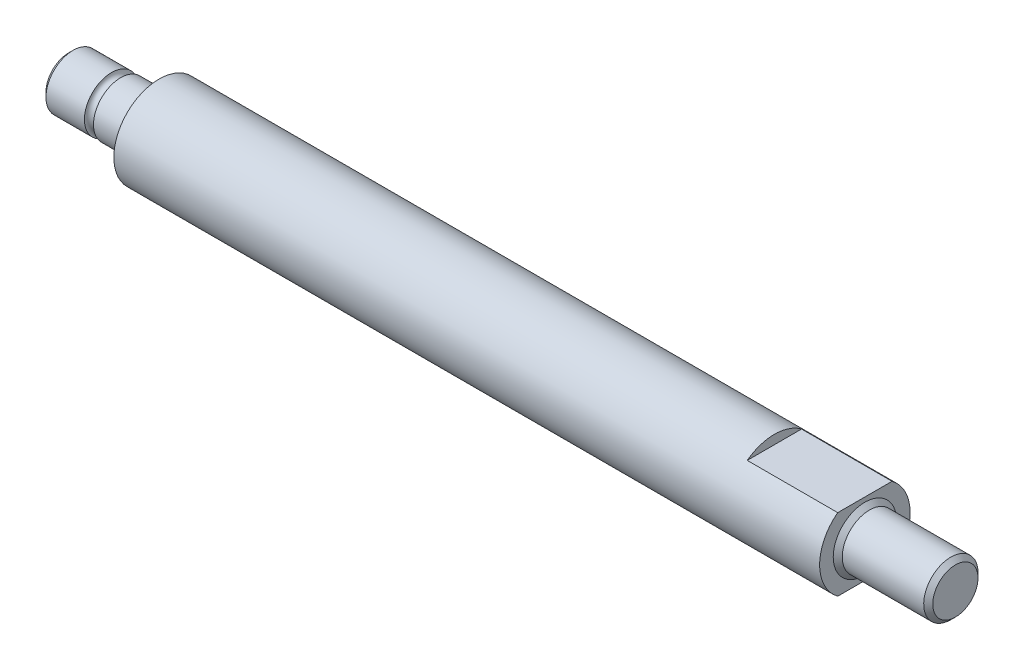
ISO-10303-21;
HEADER;
FILE_DESCRIPTION(('STEP AP214'),'2;1');
FILE_NAME('part.step','',(''),(''),'','','');
FILE_SCHEMA(('AUTOMOTIVE_DESIGN { 1 0 10303 214 1 1 1 1 }'));
ENDSEC;
DATA;
#1=APPLICATION_CONTEXT('core data for automotive mechanical design processes');
#2=APPLICATION_PROTOCOL_DEFINITION('international standard','automotive_design',2000,#1);
#3=PRODUCT_CONTEXT('',#1,'mechanical');
#4=PRODUCT('Part','Part','',(#3));
#5=PRODUCT_RELATED_PRODUCT_CATEGORY('part','',(#4));
#6=PRODUCT_DEFINITION_FORMATION('','',#4);
#7=PRODUCT_DEFINITION_CONTEXT('part definition',#1,'design');
#8=PRODUCT_DEFINITION('design','',#6,#7);
#9=PRODUCT_DEFINITION_SHAPE('','',#8);
#10=(LENGTH_UNIT() NAMED_UNIT(*) SI_UNIT(.MILLI.,.METRE.));
#11=(NAMED_UNIT(*) PLANE_ANGLE_UNIT() SI_UNIT($,.RADIAN.));
#12=(NAMED_UNIT(*) SI_UNIT($,.STERADIAN.) SOLID_ANGLE_UNIT());
#13=UNCERTAINTY_MEASURE_WITH_UNIT(LENGTH_MEASURE(1.E-05),#10,'distance_accuracy_value','');
#14=(GEOMETRIC_REPRESENTATION_CONTEXT(3) GLOBAL_UNCERTAINTY_ASSIGNED_CONTEXT((#13)) GLOBAL_UNIT_ASSIGNED_CONTEXT((#10,
#11,#12)) REPRESENTATION_CONTEXT('',''));
#15=CARTESIAN_POINT('',(0.,0.,0.));
#16=DIRECTION('',(0.,0.,1.));
#17=DIRECTION('',(1.,0.,0.));
#18=AXIS2_PLACEMENT_3D('',#15,#16,#17);
#19=CARTESIAN_POINT('',(-43.4615384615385,0.,5.00000000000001));
#20=DIRECTION('',(-1.,0.,0.));
#21=DIRECTION('',(0.,0.,1.));
#22=AXIS2_PLACEMENT_3D('',#19,#20,#21);
#23=PLANE('',#22);
#24=CARTESIAN_POINT('',(-43.4615384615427,0.,5.00000000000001));
#25=DIRECTION('',(1.,0.,0.));
#26=DIRECTION('',(0.,0.,-1.));
#27=AXIS2_PLACEMENT_3D('',#24,#25,#26);
#28=CIRCLE('',#27,2.50000000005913);
#29=CARTESIAN_POINT('',(-43.4615384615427,0.,2.49999999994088));
#30=VERTEX_POINT('',#29);
#31=EDGE_CURVE('E20',#30,#30,#28,.T.);
#32=ORIENTED_EDGE('',*,*,#31,.F.);
#33=EDGE_LOOP('',(#32));
#34=FACE_BOUND('',#33,.T.);
#35=ADVANCED_FACE('F17',(#34),#23,.T.);
#36=CARTESIAN_POINT('',(-42.9615384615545,0.,5.00000000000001));
#37=DIRECTION('',(1.,0.,0.));
#38=DIRECTION('',(0.,0.,-1.));
#39=AXIS2_PLACEMENT_3D('',#36,#37,#38);
#40=CONICAL_SURFACE('',#39,3.00000000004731,0.785398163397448);
#41=ORIENTED_EDGE('',*,*,#31,.T.);
#42=EDGE_LOOP('',(#41));
#43=FACE_BOUND('',#42,.T.);
#44=CARTESIAN_POINT('',(-42.9615384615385,0.,5.00000000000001));
#45=DIRECTION('',(1.,0.,0.));
#46=DIRECTION('',(0.,0.,-1.));
#47=AXIS2_PLACEMENT_3D('',#44,#45,#46);
#48=CIRCLE('',#47,3.);
#49=CARTESIAN_POINT('',(-42.9615384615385,0.,2.00000000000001));
#50=VERTEX_POINT('',#49);
#51=EDGE_CURVE('E98',#50,#50,#48,.T.);
#52=ORIENTED_EDGE('',*,*,#51,.F.);
#53=EDGE_LOOP('',(#52));
#54=FACE_BOUND('',#53,.T.);
#55=ADVANCED_FACE('F261',(#43,#54),#40,.T.);
#56=CARTESIAN_POINT('',(54.5384615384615,0.,5.));
#57=DIRECTION('',(1.,0.,0.));
#58=DIRECTION('',(0.,0.,-1.));
#59=AXIS2_PLACEMENT_3D('',#56,#57,#58);
#60=CYLINDRICAL_SURFACE('',#59,3.);
#61=ORIENTED_EDGE('',*,*,#51,.T.);
#62=EDGE_LOOP('',(#61));
#63=FACE_BOUND('',#62,.T.);
#64=CARTESIAN_POINT('',(-38.7115384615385,0.,5.00000000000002));
#65=DIRECTION('',(1.,0.,0.));
#66=DIRECTION('',(0.,0.,-1.));
#67=AXIS2_PLACEMENT_3D('',#64,#65,#66);
#68=CIRCLE('',#67,3.00000000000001);
#69=CARTESIAN_POINT('',(-38.7115384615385,0.,2.00000000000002));
#70=VERTEX_POINT('',#69);
#71=EDGE_CURVE('E91',#70,#70,#68,.F.);
#72=ORIENTED_EDGE('',*,*,#71,.T.);
#73=EDGE_LOOP('',(#72));
#74=FACE_BOUND('',#73,.T.);
#75=ADVANCED_FACE('F252',(#63,#74),#60,.T.);
#76=CARTESIAN_POINT('',(54.5384615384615,0.,2.00000000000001));
#77=DIRECTION('',(1.,0.,0.));
#78=DIRECTION('',(0.,0.,-1.));
#79=AXIS2_PLACEMENT_3D('',#76,#77,#78);
#80=PLANE('',#79);
#81=CARTESIAN_POINT('',(54.5384615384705,0.,5.));
#82=DIRECTION('',(-1.,0.,0.));
#83=DIRECTION('',(0.,-1.,0.));
#84=AXIS2_PLACEMENT_3D('',#81,#82,#83);
#85=CIRCLE('',#84,2.49999999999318);
#86=CARTESIAN_POINT('',(54.5384615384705,-2.49999999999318,5.));
#87=VERTEX_POINT('',#86);
#88=EDGE_CURVE('E88',#87,#87,#85,.T.);
#89=ORIENTED_EDGE('',*,*,#88,.F.);
#90=EDGE_LOOP('',(#89));
#91=FACE_BOUND('',#90,.T.);
#92=ADVANCED_FACE('F243',(#91),#80,.T.);
#93=CARTESIAN_POINT('',(-38.2115384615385,0.,5.00000000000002));
#94=DIRECTION('',(1.,0.,0.));
#95=DIRECTION('',(0.,0.,-1.));
#96=AXIS2_PLACEMENT_3D('',#93,#94,#95);
#97=TOROIDAL_SURFACE('',#96,3.00000000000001,0.499999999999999);
#98=ORIENTED_EDGE('',*,*,#71,.F.);
#99=EDGE_LOOP('',(#98));
#100=FACE_BOUND('',#99,.T.);
#101=CARTESIAN_POINT('',(-37.7115384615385,0.,5.00000000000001));
#102=DIRECTION('',(1.,0.,0.));
#103=DIRECTION('',(0.,0.,-1.));
#104=AXIS2_PLACEMENT_3D('',#101,#102,#103);
#105=CIRCLE('',#104,3.);
#106=CARTESIAN_POINT('',(-37.7115384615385,0.,2.00000000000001));
#107=VERTEX_POINT('',#106);
#108=EDGE_CURVE('E90',#107,#107,#105,.T.);
#109=ORIENTED_EDGE('',*,*,#108,.F.);
#110=EDGE_LOOP('',(#109));
#111=FACE_BOUND('',#110,.T.);
#112=ADVANCED_FACE('F235',(#100,#111),#97,.F.);
#113=CARTESIAN_POINT('',(54.0384615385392,0.,5.));
#114=DIRECTION('',(-1.,0.,0.));
#115=DIRECTION('',(0.,-1.,0.));
#116=AXIS2_PLACEMENT_3D('',#113,#114,#115);
#117=CONICAL_SURFACE('',#116,2.99999999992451,0.785398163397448);
#118=ORIENTED_EDGE('',*,*,#88,.T.);
#119=EDGE_LOOP('',(#118));
#120=FACE_BOUND('',#119,.T.);
#121=CARTESIAN_POINT('',(54.0384615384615,0.,5.));
#122=DIRECTION('',(1.,0.,0.));
#123=DIRECTION('',(0.,0.,-1.));
#124=AXIS2_PLACEMENT_3D('',#121,#122,#123);
#125=CIRCLE('',#124,2.99999999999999);
#126=CARTESIAN_POINT('',(54.0384615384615,0.,2.00000000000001));
#127=VERTEX_POINT('',#126);
#128=EDGE_CURVE('E95',#127,#127,#125,.F.);
#129=ORIENTED_EDGE('',*,*,#128,.F.);
#130=EDGE_LOOP('',(#129));
#131=FACE_BOUND('',#130,.T.);
#132=ADVANCED_FACE('F226',(#120,#131),#117,.T.);
#133=CARTESIAN_POINT('',(54.5384615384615,0.,5.));
#134=DIRECTION('',(1.,0.,0.));
#135=DIRECTION('',(0.,0.,-1.));
#136=AXIS2_PLACEMENT_3D('',#133,#134,#135);
#137=CYLINDRICAL_SURFACE('',#136,3.);
#138=ORIENTED_EDGE('',*,*,#108,.T.);
#139=EDGE_LOOP('',(#138));
#140=FACE_BOUND('',#139,.T.);
#141=CARTESIAN_POINT('',(-33.9615384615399,0.,5.00000000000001));
#142=DIRECTION('',(1.,0.,0.));
#143=DIRECTION('',(0.,0.,-1.));
#144=AXIS2_PLACEMENT_3D('',#141,#142,#143);
#145=CIRCLE('',#144,2.99999999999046);
#146=CARTESIAN_POINT('',(-33.9615384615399,0.,2.00000000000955));
#147=VERTEX_POINT('',#146);
#148=EDGE_CURVE('E294',#147,#147,#145,.T.);
#149=ORIENTED_EDGE('',*,*,#148,.F.);
#150=EDGE_LOOP('',(#149));
#151=FACE_BOUND('',#150,.T.);
#152=ADVANCED_FACE('F136',(#140,#151),#137,.T.);
#153=CARTESIAN_POINT('',(54.5384615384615,0.,5.));
#154=DIRECTION('',(1.,0.,0.));
#155=DIRECTION('',(0.,0.,-1.));
#156=AXIS2_PLACEMENT_3D('',#153,#154,#155);
#157=CYLINDRICAL_SURFACE('',#156,2.99999999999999);
#158=CARTESIAN_POINT('',(45.0384615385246,0.,5.));
#159=DIRECTION('',(-1.,0.,0.));
#160=DIRECTION('',(0.,0.,1.));
#161=AXIS2_PLACEMENT_3D('',#158,#159,#160);
#162=CIRCLE('',#161,2.99999999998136);
#163=CARTESIAN_POINT('',(45.0384615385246,0.,7.99999999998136));
#164=VERTEX_POINT('',#163);
#165=EDGE_CURVE('E63',#164,#164,#162,.T.);
#166=ORIENTED_EDGE('',*,*,#165,.F.);
#167=EDGE_LOOP('',(#166));
#168=FACE_BOUND('',#167,.T.);
#169=ORIENTED_EDGE('',*,*,#128,.T.);
#170=EDGE_LOOP('',(#169));
#171=FACE_BOUND('',#170,.T.);
#172=ADVANCED_FACE('F126',(#168,#171),#157,.T.);
#173=CARTESIAN_POINT('',(-33.4615384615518,0.,5.00000000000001));
#174=DIRECTION('',(1.,0.,0.));
#175=DIRECTION('',(0.,0.,-1.));
#176=AXIS2_PLACEMENT_3D('',#173,#174,#175);
#177=CONICAL_SURFACE('',#176,3.49999999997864,0.785398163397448);
#178=ORIENTED_EDGE('',*,*,#148,.T.);
#179=EDGE_LOOP('',(#178));
#180=FACE_BOUND('',#179,.T.);
#181=CARTESIAN_POINT('',(-33.4615384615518,0.,5.00000000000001));
#182=DIRECTION('',(1.,0.,0.));
#183=DIRECTION('',(0.,0.,-1.));
#184=AXIS2_PLACEMENT_3D('',#181,#182,#183);
#185=CIRCLE('',#184,3.49999999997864);
#186=CARTESIAN_POINT('',(-33.4615384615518,0.,1.50000000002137));
#187=VERTEX_POINT('',#186);
#188=EDGE_CURVE('E62',#187,#187,#185,.T.);
#189=ORIENTED_EDGE('',*,*,#188,.F.);
#190=EDGE_LOOP('',(#189));
#191=FACE_BOUND('',#190,.T.);
#192=ADVANCED_FACE('F123',(#180,#191),#177,.T.);
#193=CARTESIAN_POINT('',(44.5384615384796,0.,5.));
#194=DIRECTION('',(-1.,0.,0.));
#195=DIRECTION('',(0.,0.,1.));
#196=AXIS2_PLACEMENT_3D('',#193,#194,#195);
#197=CONICAL_SURFACE('',#196,3.49999999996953,0.785398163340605);
#198=ORIENTED_EDGE('',*,*,#165,.T.);
#199=EDGE_LOOP('',(#198));
#200=FACE_BOUND('',#199,.T.);
#201=CARTESIAN_POINT('',(44.5384615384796,0.,5.));
#202=DIRECTION('',(-1.,0.,0.));
#203=DIRECTION('',(0.,0.,1.));
#204=AXIS2_PLACEMENT_3D('',#201,#202,#203);
#205=CIRCLE('',#204,3.49999999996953);
#206=CARTESIAN_POINT('',(44.5384615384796,0.,8.49999999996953));
#207=VERTEX_POINT('',#206);
#208=EDGE_CURVE('E79',#207,#207,#205,.T.);
#209=ORIENTED_EDGE('',*,*,#208,.F.);
#210=EDGE_LOOP('',(#209));
#211=FACE_BOUND('',#210,.T.);
#212=ADVANCED_FACE('F125',(#200,#211),#197,.T.);
#213=CARTESIAN_POINT('',(34.5384615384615,0.,0.));
#214=DIRECTION('',(-1.,0.,0.));
#215=DIRECTION('',(0.,0.,1.));
#216=AXIS2_PLACEMENT_3D('',#213,#214,#215);
#217=PLANE('',#216);
#218=DIRECTION('',(0.,0.,1.));
#219=VECTOR('',#218,1.);
#220=CARTESIAN_POINT('',(34.5384615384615,-4.,10.442529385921));
#221=LINE('',#220,#219);
#222=CARTESIAN_POINT('',(34.5384615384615,-4.,2.));
#223=VERTEX_POINT('',#222);
#224=CARTESIAN_POINT('',(34.5384615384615,-4.,8.00000000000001));
#225=VERTEX_POINT('',#224);
#226=EDGE_CURVE('E54',#223,#225,#221,.T.);
#227=ORIENTED_EDGE('',*,*,#226,.T.);
#228=CARTESIAN_POINT('',(34.5384615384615,0.,5.));
#229=DIRECTION('',(1.,0.,0.));
#230=DIRECTION('',(0.,0.,-1.));
#231=AXIS2_PLACEMENT_3D('',#228,#229,#230);
#232=CIRCLE('',#231,5.00000000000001);
#233=EDGE_CURVE('E58',#223,#225,#232,.F.);
#234=ORIENTED_EDGE('',*,*,#233,.F.);
#235=EDGE_LOOP('',(#227,#234));
#236=FACE_BOUND('',#235,.T.);
#237=ADVANCED_FACE('F56',(#236),#217,.F.);
#238=CARTESIAN_POINT('',(34.5384615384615,-4.,10.442529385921));
#239=DIRECTION('',(0.,1.,0.));
#240=DIRECTION('',(0.,0.,1.));
#241=AXIS2_PLACEMENT_3D('',#238,#239,#240);
#242=PLANE('',#241);
#243=ORIENTED_EDGE('',*,*,#226,.F.);
#244=DIRECTION('',(1.,0.,0.));
#245=VECTOR('',#244,1.);
#246=CARTESIAN_POINT('',(54.5384615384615,-4.00000000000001,2.));
#247=LINE('',#246,#245);
#248=CARTESIAN_POINT('',(44.5384615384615,-4.,1.99999999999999));
#249=VERTEX_POINT('',#248);
#250=EDGE_CURVE('E77',#249,#223,#247,.F.);
#251=ORIENTED_EDGE('',*,*,#250,.F.);
#252=DIRECTION('',(0.,0.,-1.));
#253=VECTOR('',#252,1.);
#254=CARTESIAN_POINT('',(44.5384615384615,-4.,0.));
#255=LINE('',#254,#253);
#256=CARTESIAN_POINT('',(44.5384615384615,-4.,8.00000000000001));
#257=VERTEX_POINT('',#256);
#258=EDGE_CURVE('E70',#257,#249,#255,.T.);
#259=ORIENTED_EDGE('',*,*,#258,.F.);
#260=DIRECTION('',(1.,0.,0.));
#261=VECTOR('',#260,1.);
#262=CARTESIAN_POINT('',(54.5384615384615,-4.,8.00000000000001));
#263=LINE('',#262,#261);
#264=EDGE_CURVE('E67',#225,#257,#263,.T.);
#265=ORIENTED_EDGE('',*,*,#264,.F.);
#266=EDGE_LOOP('',(#243,#251,#259,#265));
#267=FACE_BOUND('',#266,.T.);
#268=ADVANCED_FACE('F68',(#267),#242,.F.);
#269=CARTESIAN_POINT('',(-33.4615384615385,0.,2.00000000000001));
#270=DIRECTION('',(-1.,0.,0.));
#271=DIRECTION('',(0.,0.,1.));
#272=AXIS2_PLACEMENT_3D('',#269,#270,#271);
#273=PLANE('',#272);
#274=CARTESIAN_POINT('',(-33.4615384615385,0.,5.00000000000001));
#275=DIRECTION('',(1.,0.,0.));
#276=DIRECTION('',(0.,0.,-1.));
#277=AXIS2_PLACEMENT_3D('',#274,#275,#276);
#278=CIRCLE('',#277,5.00000000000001);
#279=CARTESIAN_POINT('',(-33.4615384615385,0.,0.));
#280=VERTEX_POINT('',#279);
#281=EDGE_CURVE('E73',#280,#280,#278,.T.);
#282=ORIENTED_EDGE('',*,*,#281,.F.);
#283=EDGE_LOOP('',(#282));
#284=FACE_BOUND('',#283,.T.);
#285=ORIENTED_EDGE('',*,*,#188,.T.);
#286=EDGE_LOOP('',(#285));
#287=FACE_BOUND('',#286,.T.);
#288=ADVANCED_FACE('F116',(#284,#287),#273,.T.);
#289=CARTESIAN_POINT('',(34.5384615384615,0.,0.));
#290=DIRECTION('',(1.,0.,0.));
#291=DIRECTION('',(0.,0.,-1.));
#292=AXIS2_PLACEMENT_3D('',#289,#290,#291);
#293=PLANE('',#292);
#294=DIRECTION('',(0.,0.,-1.));
#295=VECTOR('',#294,1.);
#296=CARTESIAN_POINT('',(34.5384615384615,4.,10.442529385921));
#297=LINE('',#296,#295);
#298=CARTESIAN_POINT('',(34.5384615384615,4.,8.00000000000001));
#299=VERTEX_POINT('',#298);
#300=CARTESIAN_POINT('',(34.5384615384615,4.,1.99999999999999));
#301=VERTEX_POINT('',#300);
#302=EDGE_CURVE('E87',#299,#301,#297,.T.);
#303=ORIENTED_EDGE('',*,*,#302,.T.);
#304=CARTESIAN_POINT('',(34.5384615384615,0.,5.));
#305=DIRECTION('',(1.,0.,0.));
#306=DIRECTION('',(0.,0.,-1.));
#307=AXIS2_PLACEMENT_3D('',#304,#305,#306);
#308=CIRCLE('',#307,5.00000000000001);
#309=EDGE_CURVE('E107',#299,#301,#308,.F.);
#310=ORIENTED_EDGE('',*,*,#309,.F.);
#311=EDGE_LOOP('',(#303,#310));
#312=FACE_BOUND('',#311,.T.);
#313=ADVANCED_FACE('F119',(#312),#293,.T.);
#314=CARTESIAN_POINT('',(34.5384615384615,4.,10.442529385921));
#315=DIRECTION('',(0.,-1.,0.));
#316=DIRECTION('',(0.,0.,-1.));
#317=AXIS2_PLACEMENT_3D('',#314,#315,#316);
#318=PLANE('',#317);
#319=ORIENTED_EDGE('',*,*,#302,.F.);
#320=DIRECTION('',(1.,0.,0.));
#321=VECTOR('',#320,1.);
#322=CARTESIAN_POINT('',(54.5384615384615,4.00000000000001,8.));
#323=LINE('',#322,#321);
#324=CARTESIAN_POINT('',(44.5384615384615,4.,8.00000000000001));
#325=VERTEX_POINT('',#324);
#326=EDGE_CURVE('E109',#325,#299,#323,.F.);
#327=ORIENTED_EDGE('',*,*,#326,.F.);
#328=DIRECTION('',(0.,0.,-1.));
#329=VECTOR('',#328,1.);
#330=CARTESIAN_POINT('',(44.5384615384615,4.,0.));
#331=LINE('',#330,#329);
#332=CARTESIAN_POINT('',(44.5384615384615,4.,1.99999999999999));
#333=VERTEX_POINT('',#332);
#334=EDGE_CURVE('E35',#333,#325,#331,.F.);
#335=ORIENTED_EDGE('',*,*,#334,.F.);
#336=DIRECTION('',(1.,0.,0.));
#337=VECTOR('',#336,1.);
#338=CARTESIAN_POINT('',(54.5384615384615,4.,1.99999999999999));
#339=LINE('',#338,#337);
#340=EDGE_CURVE('E26',#301,#333,#339,.T.);
#341=ORIENTED_EDGE('',*,*,#340,.F.);
#342=EDGE_LOOP('',(#319,#327,#335,#341));
#343=FACE_BOUND('',#342,.T.);
#344=ADVANCED_FACE('F146',(#343),#318,.F.);
#345=CARTESIAN_POINT('',(44.5384615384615,0.,0.));
#346=DIRECTION('',(1.,0.,0.));
#347=DIRECTION('',(0.,0.,-1.));
#348=AXIS2_PLACEMENT_3D('',#345,#346,#347);
#349=PLANE('',#348);
#350=ORIENTED_EDGE('',*,*,#208,.T.);
#351=EDGE_LOOP('',(#350));
#352=FACE_BOUND('',#351,.T.);
#353=CARTESIAN_POINT('',(44.5384615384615,0.,5.));
#354=DIRECTION('',(1.,0.,0.));
#355=DIRECTION('',(0.,0.,-1.));
#356=AXIS2_PLACEMENT_3D('',#353,#354,#355);
#357=CIRCLE('',#356,5.00000000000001);
#358=EDGE_CURVE('E110',#257,#325,#357,.F.);
#359=ORIENTED_EDGE('',*,*,#358,.F.);
#360=ORIENTED_EDGE('',*,*,#258,.T.);
#361=CARTESIAN_POINT('',(44.5384615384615,0.,5.));
#362=DIRECTION('',(1.,0.,0.));
#363=DIRECTION('',(0.,0.,-1.));
#364=AXIS2_PLACEMENT_3D('',#361,#362,#363);
#365=CIRCLE('',#364,5.00000000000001);
#366=EDGE_CURVE('E11',#333,#249,#365,.F.);
#367=ORIENTED_EDGE('',*,*,#366,.F.);
#368=ORIENTED_EDGE('',*,*,#334,.T.);
#369=EDGE_LOOP('',(#359,#360,#367,#368));
#370=FACE_BOUND('',#369,.T.);
#371=ADVANCED_FACE('F141',(#352,#370),#349,.T.);
#372=CARTESIAN_POINT('',(54.5384615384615,0.,5.));
#373=DIRECTION('',(1.,0.,0.));
#374=DIRECTION('',(0.,0.,-1.));
#375=AXIS2_PLACEMENT_3D('',#372,#373,#374);
#376=CYLINDRICAL_SURFACE('',#375,5.00000000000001);
#377=ORIENTED_EDGE('',*,*,#264,.T.);
#378=ORIENTED_EDGE('',*,*,#358,.T.);
#379=ORIENTED_EDGE('',*,*,#326,.T.);
#380=ORIENTED_EDGE('',*,*,#309,.T.);
#381=ORIENTED_EDGE('',*,*,#340,.T.);
#382=ORIENTED_EDGE('',*,*,#366,.T.);
#383=ORIENTED_EDGE('',*,*,#250,.T.);
#384=ORIENTED_EDGE('',*,*,#233,.T.);
#385=EDGE_LOOP('',(#377,#378,#379,#380,#381,#382,#383,#384));
#386=FACE_BOUND('',#385,.T.);
#387=ORIENTED_EDGE('',*,*,#281,.T.);
#388=EDGE_LOOP('',(#387));
#389=FACE_BOUND('',#388,.T.);
#390=ADVANCED_FACE('F75',(#386,#389),#376,.T.);
#391=CLOSED_SHELL('',(#35,#55,#75,#92,#112,#132,#152,#172,#192,#212,#237,#268,#288,#313,#344,
#371,#390));
#392=MANIFOLD_SOLID_BREP('B1',#391);
#393=ADVANCED_BREP_SHAPE_REPRESENTATION('',(#18,#392),#14);
#394=SHAPE_DEFINITION_REPRESENTATION(#9,#393);
ENDSEC;
END-ISO-10303-21;
